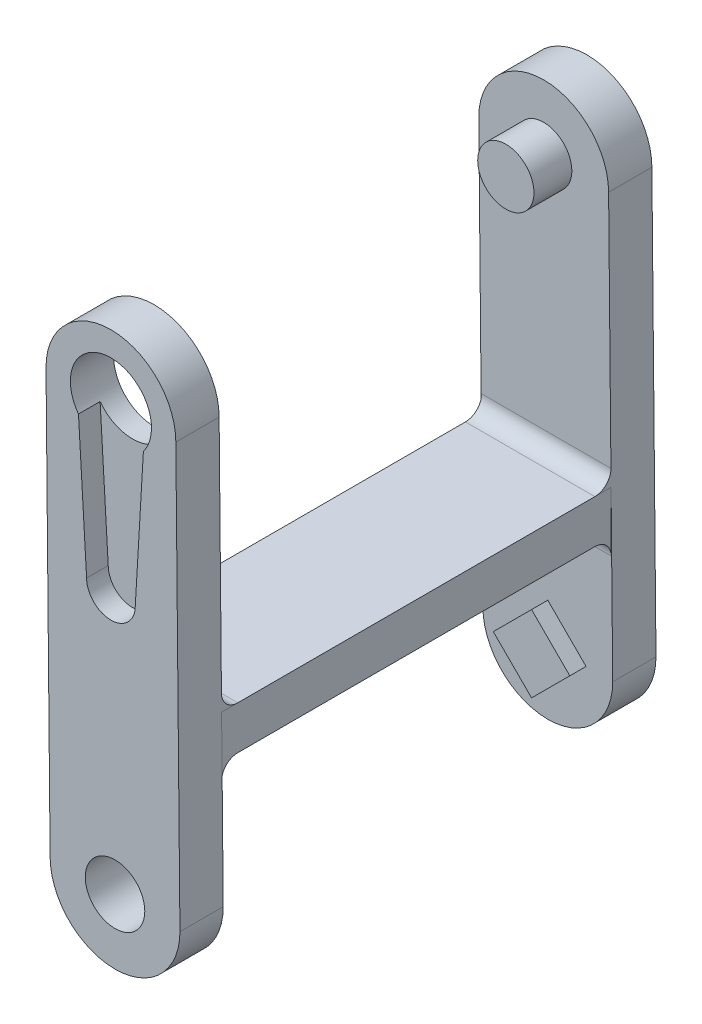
ISO-10303-21;
HEADER;
FILE_DESCRIPTION(('STEP AP214'),'2;1');
FILE_NAME('part.step','',(''),(''),'','','');
FILE_SCHEMA(('AUTOMOTIVE_DESIGN { 1 0 10303 214 1 1 1 1 }'));
ENDSEC;
DATA;
#1=APPLICATION_CONTEXT('core data for automotive mechanical design processes');
#2=APPLICATION_PROTOCOL_DEFINITION('international standard','automotive_design',2000,#1);
#3=PRODUCT_CONTEXT('',#1,'mechanical');
#4=PRODUCT('Part','Part','',(#3));
#5=PRODUCT_RELATED_PRODUCT_CATEGORY('part','',(#4));
#6=PRODUCT_DEFINITION_FORMATION('','',#4);
#7=PRODUCT_DEFINITION_CONTEXT('part definition',#1,'design');
#8=PRODUCT_DEFINITION('design','',#6,#7);
#9=PRODUCT_DEFINITION_SHAPE('','',#8);
#10=(LENGTH_UNIT() NAMED_UNIT(*) SI_UNIT(.MILLI.,.METRE.));
#11=(NAMED_UNIT(*) PLANE_ANGLE_UNIT() SI_UNIT($,.RADIAN.));
#12=(NAMED_UNIT(*) SI_UNIT($,.STERADIAN.) SOLID_ANGLE_UNIT());
#13=UNCERTAINTY_MEASURE_WITH_UNIT(LENGTH_MEASURE(1.E-05),#10,'distance_accuracy_value','');
#14=(GEOMETRIC_REPRESENTATION_CONTEXT(3) GLOBAL_UNCERTAINTY_ASSIGNED_CONTEXT((#13)) GLOBAL_UNIT_ASSIGNED_CONTEXT((#10,
#11,#12)) REPRESENTATION_CONTEXT('',''));
#15=CARTESIAN_POINT('',(0.,0.,0.));
#16=DIRECTION('',(0.,0.,1.));
#17=DIRECTION('',(1.,0.,0.));
#18=AXIS2_PLACEMENT_3D('',#15,#16,#17);
#19=CARTESIAN_POINT('',(0.,0.,0.));
#20=DIRECTION('',(0.,0.,1.));
#21=DIRECTION('',(1.,0.,0.));
#22=AXIS2_PLACEMENT_3D('',#19,#20,#21);
#23=PLANE('',#22);
#24=CARTESIAN_POINT('',(4.90777895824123,0.,0.));
#25=DIRECTION('',(0.,0.,1.));
#26=DIRECTION('',(1.,0.,0.));
#27=AXIS2_PLACEMENT_3D('',#24,#25,#26);
#28=CIRCLE('',#27,3.75);
#29=CARTESIAN_POINT('',(8.65777895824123,0.,0.));
#30=VERTEX_POINT('',#29);
#31=EDGE_CURVE('E229',#30,#30,#28,.T.);
#32=ORIENTED_EDGE('',*,*,#31,.T.);
#33=EDGE_LOOP('',(#32));
#34=FACE_BOUND('',#33,.T.);
#35=DIRECTION('',(0.00972429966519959,-0.999952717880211,0.));
#36=VECTOR('',#35,1.);
#37=CARTESIAN_POINT('',(10.906747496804,0.106065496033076,0.));
#38=LINE('',#37,#36);
#39=CARTESIAN_POINT('',(10.9077789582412,0.,0.));
#40=VERTEX_POINT('',#39);
#41=CARTESIAN_POINT('',(11.121723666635,-22.,0.));
#42=VERTEX_POINT('',#41);
#43=EDGE_CURVE('E265',#40,#42,#38,.T.);
#44=ORIENTED_EDGE('',*,*,#43,.T.);
#45=DIRECTION('',(1.,0.,0.));
#46=VECTOR('',#45,1.);
#47=CARTESIAN_POINT('',(-0.824790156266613,-22.,0.));
#48=LINE('',#47,#46);
#49=CARTESIAN_POINT('',(-0.824790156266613,-22.,0.));
#50=VERTEX_POINT('',#49);
#51=EDGE_CURVE('E174',#42,#50,#48,.F.);
#52=ORIENTED_EDGE('',*,*,#51,.T.);
#53=DIRECTION('',(0.,1.,0.));
#54=VECTOR('',#53,1.);
#55=CARTESIAN_POINT('',(-0.824790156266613,-27.5,0.));
#56=LINE('',#55,#54);
#57=CARTESIAN_POINT('',(-0.824790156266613,-27.5,0.));
#58=VERTEX_POINT('',#57);
#59=EDGE_CURVE('E297',#58,#50,#56,.T.);
#60=ORIENTED_EDGE('',*,*,#59,.F.);
#61=DIRECTION('',(0.00972429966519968,-0.999952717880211,0.));
#62=VECTOR('',#61,1.);
#63=CARTESIAN_POINT('',(-1.09211775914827,-0.0106205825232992,0.));
#64=LINE('',#63,#62);
#65=CARTESIAN_POINT('',(-1.09222104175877,0.,0.));
#66=VERTEX_POINT('',#65);
#67=EDGE_CURVE('E258',#66,#58,#64,.T.);
#68=ORIENTED_EDGE('',*,*,#67,.F.);
#69=CARTESIAN_POINT('',(4.90777895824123,0.,0.));
#70=DIRECTION('',(0.,0.,1.));
#71=DIRECTION('',(1.,0.,0.));
#72=AXIS2_PLACEMENT_3D('',#69,#70,#71);
#73=CIRCLE('',#72,6.);
#74=EDGE_CURVE('E242',#40,#66,#73,.T.);
#75=ORIENTED_EDGE('',*,*,#74,.F.);
#76=EDGE_LOOP('',(#44,#52,#60,#68,#75));
#77=FACE_BOUND('',#76,.T.);
#78=ADVANCED_FACE('F34',(#34,#77),#23,.F.);
#79=CARTESIAN_POINT('',(5.28704457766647,-39.,0.));
#80=DIRECTION('',(0.,0.,1.));
#81=DIRECTION('',(1.,0.,0.));
#82=AXIS2_PLACEMENT_3D('',#79,#80,#81);
#83=CIRCLE('',#82,2.75);
#84=CARTESIAN_POINT('',(8.03704457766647,-39.,0.));
#85=VERTEX_POINT('',#84);
#86=EDGE_CURVE('E339',#85,#85,#83,.F.);
#87=ORIENTED_EDGE('',*,*,#86,.F.);
#88=EDGE_LOOP('',(#87));
#89=FACE_BOUND('',#88,.T.);
#90=CARTESIAN_POINT('',(-0.81020301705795,-29.,0.));
#91=VERTEX_POINT('',#90);
#92=CARTESIAN_POINT('',(-0.71295542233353,-39.,0.));
#93=VERTEX_POINT('',#92);
#94=EDGE_CURVE('E257',#91,#93,#64,.T.);
#95=ORIENTED_EDGE('',*,*,#94,.F.);
#96=DIRECTION('',(-1.,0.,0.));
#97=VECTOR('',#96,1.);
#98=CARTESIAN_POINT('',(11.1363108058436,-29.,0.));
#99=LINE('',#98,#97);
#100=CARTESIAN_POINT('',(11.1363108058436,-29.,0.));
#101=VERTEX_POINT('',#100);
#102=EDGE_CURVE('E162',#91,#101,#99,.F.);
#103=ORIENTED_EDGE('',*,*,#102,.T.);
#104=DIRECTION('',(0.,-1.,0.));
#105=VECTOR('',#104,1.);
#106=CARTESIAN_POINT('',(11.1363108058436,-27.5,0.));
#107=LINE('',#106,#105);
#108=CARTESIAN_POINT('',(11.1363108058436,-23.5,0.));
#109=VERTEX_POINT('',#108);
#110=EDGE_CURVE('E295',#109,#101,#107,.T.);
#111=ORIENTED_EDGE('',*,*,#110,.F.);
#112=CARTESIAN_POINT('',(11.2870445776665,-39.,0.));
#113=VERTEX_POINT('',#112);
#114=EDGE_CURVE('E264',#109,#113,#38,.T.);
#115=ORIENTED_EDGE('',*,*,#114,.T.);
#116=CARTESIAN_POINT('',(5.28704457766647,-39.,0.));
#117=DIRECTION('',(0.,0.,1.));
#118=DIRECTION('',(1.,0.,0.));
#119=AXIS2_PLACEMENT_3D('',#116,#117,#118);
#120=CIRCLE('',#119,6.);
#121=EDGE_CURVE('E261',#93,#113,#120,.T.);
#122=ORIENTED_EDGE('',*,*,#121,.F.);
#123=EDGE_LOOP('',(#95,#103,#111,#115,#122));
#124=FACE_BOUND('',#123,.T.);
#125=ADVANCED_FACE('F489',(#89,#124),#23,.F.);
#126=CARTESIAN_POINT('',(-1.09211775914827,-0.0106205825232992,4.));
#127=DIRECTION('',(0.999952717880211,0.00972429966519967,0.));
#128=DIRECTION('',(-0.00972429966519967,0.999952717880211,0.));
#129=AXIS2_PLACEMENT_3D('',#126,#127,#128);
#130=PLANE('',#129);
#131=ORIENTED_EDGE('',*,*,#67,.T.);
#132=DIRECTION('',(0.,0.,-1.));
#133=VECTOR('',#132,1.);
#134=CARTESIAN_POINT('',(-0.824790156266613,-27.5,4.));
#135=LINE('',#134,#133);
#136=CARTESIAN_POINT('',(-0.824790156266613,-27.5,-1.5));
#137=VERTEX_POINT('',#136);
#138=EDGE_CURVE('E112',#58,#137,#135,.T.);
#139=ORIENTED_EDGE('',*,*,#138,.T.);
#140=CARTESIAN_POINT('',(-0.81020301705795,-29.,-1.5));
#141=DIRECTION('',(0.999952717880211,0.00972429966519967,0.));
#142=DIRECTION('',(0.00972429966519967,-0.999952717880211,0.));
#143=AXIS2_PLACEMENT_3D('',#140,#141,#142);
#144=ELLIPSE('',#143,1.50007092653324,1.5);
#145=EDGE_CURVE('E102',#137,#91,#144,.T.);
#146=ORIENTED_EDGE('',*,*,#145,.T.);
#147=ORIENTED_EDGE('',*,*,#94,.T.);
#148=DIRECTION('',(0.,0.,-1.));
#149=VECTOR('',#148,1.);
#150=CARTESIAN_POINT('',(-0.71295542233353,-39.,4.));
#151=LINE('',#150,#149);
#152=CARTESIAN_POINT('',(-0.71295542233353,-39.,4.));
#153=VERTEX_POINT('',#152);
#154=EDGE_CURVE('E278',#153,#93,#151,.T.);
#155=ORIENTED_EDGE('',*,*,#154,.F.);
#156=DIRECTION('',(0.00972429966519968,-0.999952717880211,0.));
#157=VECTOR('',#156,1.);
#158=CARTESIAN_POINT('',(-1.09211775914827,-0.0106205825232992,4.));
#159=LINE('',#158,#157);
#160=CARTESIAN_POINT('',(-1.09222104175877,0.,4.));
#161=VERTEX_POINT('',#160);
#162=EDGE_CURVE('E241',#161,#153,#159,.T.);
#163=ORIENTED_EDGE('',*,*,#162,.F.);
#164=DIRECTION('',(0.,0.,-1.));
#165=VECTOR('',#164,1.);
#166=CARTESIAN_POINT('',(-1.09222104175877,0.,4.));
#167=LINE('',#166,#165);
#168=EDGE_CURVE('E254',#161,#66,#167,.T.);
#169=ORIENTED_EDGE('',*,*,#168,.T.);
#170=EDGE_LOOP('',(#131,#139,#146,#147,#155,#163,#169));
#171=FACE_BOUND('',#170,.T.);
#172=ADVANCED_FACE('F480',(#171),#130,.F.);
#173=CARTESIAN_POINT('',(5.28704457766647,-39.,4.));
#174=DIRECTION('',(0.,0.,-1.));
#175=DIRECTION('',(-1.,0.,0.));
#176=AXIS2_PLACEMENT_3D('',#173,#174,#175);
#177=CYLINDRICAL_SURFACE('',#176,6.);
#178=ORIENTED_EDGE('',*,*,#121,.T.);
#179=DIRECTION('',(0.,0.,-1.));
#180=VECTOR('',#179,1.);
#181=CARTESIAN_POINT('',(11.2870445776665,-39.,4.));
#182=LINE('',#181,#180);
#183=CARTESIAN_POINT('',(11.2870445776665,-39.,4.));
#184=VERTEX_POINT('',#183);
#185=EDGE_CURVE('E275',#184,#113,#182,.T.);
#186=ORIENTED_EDGE('',*,*,#185,.F.);
#187=CARTESIAN_POINT('',(5.28704457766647,-39.,4.));
#188=DIRECTION('',(0.,0.,1.));
#189=DIRECTION('',(1.,0.,0.));
#190=AXIS2_PLACEMENT_3D('',#187,#188,#189);
#191=CIRCLE('',#190,6.);
#192=EDGE_CURVE('E245',#153,#184,#191,.T.);
#193=ORIENTED_EDGE('',*,*,#192,.F.);
#194=ORIENTED_EDGE('',*,*,#154,.T.);
#195=EDGE_LOOP('',(#178,#186,#193,#194));
#196=FACE_BOUND('',#195,.T.);
#197=ADVANCED_FACE('F506',(#196),#177,.T.);
#198=CARTESIAN_POINT('',(10.906747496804,0.106065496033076,4.));
#199=DIRECTION('',(0.999952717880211,0.00972429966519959,0.));
#200=DIRECTION('',(-0.00972429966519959,0.999952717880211,0.));
#201=AXIS2_PLACEMENT_3D('',#198,#199,#200);
#202=PLANE('',#201);
#203=ORIENTED_EDGE('',*,*,#43,.F.);
#204=DIRECTION('',(0.,0.,-1.));
#205=VECTOR('',#204,1.);
#206=CARTESIAN_POINT('',(10.9077789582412,0.,4.));
#207=LINE('',#206,#205);
#208=CARTESIAN_POINT('',(10.9077789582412,0.,4.));
#209=VERTEX_POINT('',#208);
#210=EDGE_CURVE('E272',#209,#40,#207,.T.);
#211=ORIENTED_EDGE('',*,*,#210,.F.);
#212=DIRECTION('',(0.00972429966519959,-0.999952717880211,0.));
#213=VECTOR('',#212,1.);
#214=CARTESIAN_POINT('',(10.906747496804,0.106065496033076,4.));
#215=LINE('',#214,#213);
#216=EDGE_CURVE('E248',#209,#184,#215,.T.);
#217=ORIENTED_EDGE('',*,*,#216,.T.);
#218=ORIENTED_EDGE('',*,*,#185,.T.);
#219=ORIENTED_EDGE('',*,*,#114,.F.);
#220=DIRECTION('',(0.,0.,-1.));
#221=VECTOR('',#220,1.);
#222=CARTESIAN_POINT('',(11.1363108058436,-23.5,-36.));
#223=LINE('',#222,#221);
#224=CARTESIAN_POINT('',(11.1363108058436,-23.5,-1.5));
#225=VERTEX_POINT('',#224);
#226=EDGE_CURVE('E11',#109,#225,#223,.T.);
#227=ORIENTED_EDGE('',*,*,#226,.T.);
#228=CARTESIAN_POINT('',(11.121723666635,-22.,-1.5));
#229=DIRECTION('',(0.999952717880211,0.00972429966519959,0.));
#230=DIRECTION('',(-0.00972429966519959,0.999952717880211,0.));
#231=AXIS2_PLACEMENT_3D('',#228,#229,#230);
#232=ELLIPSE('',#231,1.50007092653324,1.5);
#233=EDGE_CURVE('E72',#225,#42,#232,.F.);
#234=ORIENTED_EDGE('',*,*,#233,.T.);
#235=EDGE_LOOP('',(#203,#211,#217,#218,#219,#227,#234));
#236=FACE_BOUND('',#235,.T.);
#237=ADVANCED_FACE('F503',(#236),#202,.T.);
#238=CARTESIAN_POINT('',(4.90777895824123,0.,4.));
#239=DIRECTION('',(0.,0.,-1.));
#240=DIRECTION('',(-1.,0.,0.));
#241=AXIS2_PLACEMENT_3D('',#238,#239,#240);
#242=CYLINDRICAL_SURFACE('',#241,3.75);
#243=DIRECTION('',(0.,0.,1.));
#244=VECTOR('',#243,1.);
#245=CARTESIAN_POINT('',(1.90777895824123,-2.25,2.));
#246=LINE('',#245,#244);
#247=CARTESIAN_POINT('',(1.90777895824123,-2.25,2.));
#248=VERTEX_POINT('',#247);
#249=CARTESIAN_POINT('',(1.90777895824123,-2.25,4.));
#250=VERTEX_POINT('',#249);
#251=EDGE_CURVE('E230',#248,#250,#246,.T.);
#252=ORIENTED_EDGE('',*,*,#251,.F.);
#253=CARTESIAN_POINT('',(4.90777895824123,0.,2.));
#254=DIRECTION('',(0.,0.,1.));
#255=DIRECTION('',(1.,0.,0.));
#256=AXIS2_PLACEMENT_3D('',#253,#254,#255);
#257=CIRCLE('',#256,3.75);
#258=CARTESIAN_POINT('',(7.90777895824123,-2.25,2.));
#259=VERTEX_POINT('',#258);
#260=EDGE_CURVE('E281',#248,#259,#257,.T.);
#261=ORIENTED_EDGE('',*,*,#260,.T.);
#262=DIRECTION('',(0.,0.,1.));
#263=VECTOR('',#262,1.);
#264=CARTESIAN_POINT('',(7.90777895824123,-2.25,2.));
#265=LINE('',#264,#263);
#266=CARTESIAN_POINT('',(7.90777895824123,-2.25,4.));
#267=VERTEX_POINT('',#266);
#268=EDGE_CURVE('E233',#259,#267,#265,.T.);
#269=ORIENTED_EDGE('',*,*,#268,.T.);
#270=CARTESIAN_POINT('',(4.90777895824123,0.,4.));
#271=DIRECTION('',(0.,0.,1.));
#272=DIRECTION('',(1.,0.,0.));
#273=AXIS2_PLACEMENT_3D('',#270,#271,#272);
#274=CIRCLE('',#273,3.75);
#275=EDGE_CURVE('E238',#267,#250,#274,.T.);
#276=ORIENTED_EDGE('',*,*,#275,.T.);
#277=EDGE_LOOP('',(#252,#261,#269,#276));
#278=FACE_BOUND('',#277,.T.);
#279=ORIENTED_EDGE('',*,*,#31,.F.);
#280=EDGE_LOOP('',(#279));
#281=FACE_BOUND('',#280,.T.);
#282=ADVANCED_FACE('F502',(#278,#281),#242,.F.);
#283=CARTESIAN_POINT('',(4.90777895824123,0.,4.));
#284=DIRECTION('',(0.,0.,-1.));
#285=DIRECTION('',(-1.,0.,0.));
#286=AXIS2_PLACEMENT_3D('',#283,#284,#285);
#287=CYLINDRICAL_SURFACE('',#286,6.);
#288=ORIENTED_EDGE('',*,*,#74,.T.);
#289=ORIENTED_EDGE('',*,*,#168,.F.);
#290=CARTESIAN_POINT('',(4.90777895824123,0.,4.));
#291=DIRECTION('',(0.,0.,1.));
#292=DIRECTION('',(1.,0.,0.));
#293=AXIS2_PLACEMENT_3D('',#290,#291,#292);
#294=CIRCLE('',#293,6.);
#295=EDGE_CURVE('E251',#209,#161,#294,.T.);
#296=ORIENTED_EDGE('',*,*,#295,.F.);
#297=ORIENTED_EDGE('',*,*,#210,.T.);
#298=EDGE_LOOP('',(#288,#289,#296,#297));
#299=FACE_BOUND('',#298,.T.);
#300=ADVANCED_FACE('F473',(#299),#287,.T.);
#301=CARTESIAN_POINT('',(0.,0.,4.));
#302=DIRECTION('',(0.,0.,1.));
#303=DIRECTION('',(1.,0.,0.));
#304=AXIS2_PLACEMENT_3D('',#301,#302,#303);
#305=PLANE('',#304);
#306=CARTESIAN_POINT('',(5.28704457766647,-39.,4.));
#307=DIRECTION('',(0.,0.,1.));
#308=DIRECTION('',(1.,0.,0.));
#309=AXIS2_PLACEMENT_3D('',#306,#307,#308);
#310=CIRCLE('',#309,2.75);
#311=CARTESIAN_POINT('',(8.03704457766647,-39.,4.));
#312=VERTEX_POINT('',#311);
#313=EDGE_CURVE('E342',#312,#312,#310,.T.);
#314=ORIENTED_EDGE('',*,*,#313,.F.);
#315=EDGE_LOOP('',(#314));
#316=FACE_BOUND('',#315,.T.);
#317=DIRECTION('',(0.0587220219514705,-0.998274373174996,0.));
#318=VECTOR('',#317,1.);
#319=CARTESIAN_POINT('',(2.65777895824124,-15.,4.));
#320=LINE('',#319,#318);
#321=CARTESIAN_POINT('',(2.65777895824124,-15.,4.));
#322=VERTEX_POINT('',#321);
#323=EDGE_CURVE('E215',#250,#322,#320,.T.);
#324=ORIENTED_EDGE('',*,*,#323,.F.);
#325=ORIENTED_EDGE('',*,*,#275,.F.);
#326=DIRECTION('',(0.0587220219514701,0.998274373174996,0.));
#327=VECTOR('',#326,1.);
#328=CARTESIAN_POINT('',(7.15777895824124,-15.,4.));
#329=LINE('',#328,#327);
#330=CARTESIAN_POINT('',(7.15777895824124,-15.,4.));
#331=VERTEX_POINT('',#330);
#332=EDGE_CURVE('E206',#331,#267,#329,.T.);
#333=ORIENTED_EDGE('',*,*,#332,.F.);
#334=CARTESIAN_POINT('',(4.90777895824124,-15.,4.));
#335=DIRECTION('',(0.,0.,1.));
#336=DIRECTION('',(1.,0.,0.));
#337=AXIS2_PLACEMENT_3D('',#334,#335,#336);
#338=CIRCLE('',#337,2.25);
#339=EDGE_CURVE('E204',#322,#331,#338,.T.);
#340=ORIENTED_EDGE('',*,*,#339,.F.);
#341=EDGE_LOOP('',(#324,#325,#333,#340));
#342=FACE_BOUND('',#341,.T.);
#343=ORIENTED_EDGE('',*,*,#162,.T.);
#344=ORIENTED_EDGE('',*,*,#192,.T.);
#345=ORIENTED_EDGE('',*,*,#216,.F.);
#346=ORIENTED_EDGE('',*,*,#295,.T.);
#347=EDGE_LOOP('',(#343,#344,#345,#346));
#348=FACE_BOUND('',#347,.T.);
#349=ADVANCED_FACE('F498',(#316,#342,#348),#305,.T.);
#350=CARTESIAN_POINT('',(4.90777895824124,-15.,2.));
#351=DIRECTION('',(0.,0.,1.));
#352=DIRECTION('',(1.,0.,0.));
#353=AXIS2_PLACEMENT_3D('',#350,#351,#352);
#354=CYLINDRICAL_SURFACE('',#353,2.25);
#355=ORIENTED_EDGE('',*,*,#339,.T.);
#356=DIRECTION('',(0.,0.,1.));
#357=VECTOR('',#356,1.);
#358=CARTESIAN_POINT('',(7.15777895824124,-15.,2.));
#359=LINE('',#358,#357);
#360=CARTESIAN_POINT('',(7.15777895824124,-15.,2.));
#361=VERTEX_POINT('',#360);
#362=EDGE_CURVE('E220',#361,#331,#359,.T.);
#363=ORIENTED_EDGE('',*,*,#362,.F.);
#364=CARTESIAN_POINT('',(4.90777895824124,-15.,2.));
#365=DIRECTION('',(0.,0.,1.));
#366=DIRECTION('',(1.,0.,0.));
#367=AXIS2_PLACEMENT_3D('',#364,#365,#366);
#368=CIRCLE('',#367,2.25);
#369=CARTESIAN_POINT('',(2.65777895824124,-15.,2.));
#370=VERTEX_POINT('',#369);
#371=EDGE_CURVE('E211',#370,#361,#368,.T.);
#372=ORIENTED_EDGE('',*,*,#371,.F.);
#373=DIRECTION('',(0.,0.,1.));
#374=VECTOR('',#373,1.);
#375=CARTESIAN_POINT('',(2.65777895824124,-15.,2.));
#376=LINE('',#375,#374);
#377=EDGE_CURVE('E226',#370,#322,#376,.T.);
#378=ORIENTED_EDGE('',*,*,#377,.T.);
#379=EDGE_LOOP('',(#355,#363,#372,#378));
#380=FACE_BOUND('',#379,.T.);
#381=ADVANCED_FACE('F641',(#380),#354,.F.);
#382=CARTESIAN_POINT('',(2.65777895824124,-15.,2.));
#383=DIRECTION('',(-0.998274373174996,-0.0587220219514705,0.));
#384=DIRECTION('',(0.0587220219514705,-0.998274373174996,0.));
#385=AXIS2_PLACEMENT_3D('',#382,#383,#384);
#386=PLANE('',#385);
#387=ORIENTED_EDGE('',*,*,#323,.T.);
#388=ORIENTED_EDGE('',*,*,#377,.F.);
#389=DIRECTION('',(0.0587220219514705,-0.998274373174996,0.));
#390=VECTOR('',#389,1.);
#391=CARTESIAN_POINT('',(2.65777895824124,-15.,2.));
#392=LINE('',#391,#390);
#393=EDGE_CURVE('E218',#248,#370,#392,.T.);
#394=ORIENTED_EDGE('',*,*,#393,.F.);
#395=ORIENTED_EDGE('',*,*,#251,.T.);
#396=EDGE_LOOP('',(#387,#388,#394,#395));
#397=FACE_BOUND('',#396,.T.);
#398=ADVANCED_FACE('F638',(#397),#386,.F.);
#399=CARTESIAN_POINT('',(7.15777895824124,-15.,2.));
#400=DIRECTION('',(0.998274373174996,-0.0587220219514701,0.));
#401=DIRECTION('',(0.0587220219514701,0.998274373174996,0.));
#402=AXIS2_PLACEMENT_3D('',#399,#400,#401);
#403=PLANE('',#402);
#404=ORIENTED_EDGE('',*,*,#332,.T.);
#405=ORIENTED_EDGE('',*,*,#268,.F.);
#406=DIRECTION('',(0.0587220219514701,0.998274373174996,0.));
#407=VECTOR('',#406,1.);
#408=CARTESIAN_POINT('',(7.15777895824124,-15.,2.));
#409=LINE('',#408,#407);
#410=EDGE_CURVE('E214',#361,#259,#409,.T.);
#411=ORIENTED_EDGE('',*,*,#410,.F.);
#412=ORIENTED_EDGE('',*,*,#362,.T.);
#413=EDGE_LOOP('',(#404,#405,#411,#412));
#414=FACE_BOUND('',#413,.T.);
#415=ADVANCED_FACE('F636',(#414),#403,.F.);
#416=CARTESIAN_POINT('',(4.90777895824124,-15.,2.));
#417=DIRECTION('',(0.,0.,1.));
#418=DIRECTION('',(1.,0.,0.));
#419=AXIS2_PLACEMENT_3D('',#416,#417,#418);
#420=PLANE('',#419);
#421=ORIENTED_EDGE('',*,*,#393,.T.);
#422=ORIENTED_EDGE('',*,*,#371,.T.);
#423=ORIENTED_EDGE('',*,*,#410,.T.);
#424=ORIENTED_EDGE('',*,*,#260,.F.);
#425=EDGE_LOOP('',(#421,#422,#423,#424));
#426=FACE_BOUND('',#425,.T.);
#427=ADVANCED_FACE('F633',(#426),#420,.T.);
#428=CARTESIAN_POINT('',(-0.824790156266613,-27.5,-36.));
#429=DIRECTION('',(1.,0.,0.));
#430=DIRECTION('',(0.,0.,-1.));
#431=AXIS2_PLACEMENT_3D('',#428,#429,#430);
#432=PLANE('',#431);
#433=ORIENTED_EDGE('',*,*,#59,.T.);
#434=CARTESIAN_POINT('',(-0.824790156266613,-22.,-1.5));
#435=DIRECTION('',(1.,0.,0.));
#436=DIRECTION('',(0.,0.,-1.));
#437=AXIS2_PLACEMENT_3D('',#434,#435,#436);
#438=CIRCLE('',#437,1.5);
#439=CARTESIAN_POINT('',(-0.824790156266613,-23.5,-1.5));
#440=VERTEX_POINT('',#439);
#441=EDGE_CURVE('E185',#50,#440,#438,.T.);
#442=ORIENTED_EDGE('',*,*,#441,.T.);
#443=DIRECTION('',(0.,0.,1.));
#444=VECTOR('',#443,1.);
#445=CARTESIAN_POINT('',(-0.824790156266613,-23.5,-36.));
#446=LINE('',#445,#444);
#447=CARTESIAN_POINT('',(-0.824790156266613,-23.5,-34.5));
#448=VERTEX_POINT('',#447);
#449=EDGE_CURVE('E201',#448,#440,#446,.T.);
#450=ORIENTED_EDGE('',*,*,#449,.F.);
#451=CARTESIAN_POINT('',(-0.824790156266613,-22.,-34.5));
#452=DIRECTION('',(1.,0.,0.));
#453=DIRECTION('',(0.,0.,-1.));
#454=AXIS2_PLACEMENT_3D('',#451,#452,#453);
#455=CIRCLE('',#454,1.5);
#456=CARTESIAN_POINT('',(-0.824790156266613,-22.,-36.));
#457=VERTEX_POINT('',#456);
#458=EDGE_CURVE('E182',#448,#457,#455,.T.);
#459=ORIENTED_EDGE('',*,*,#458,.T.);
#460=DIRECTION('',(0.,1.,0.));
#461=VECTOR('',#460,1.);
#462=CARTESIAN_POINT('',(-0.824790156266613,-27.5,-36.));
#463=LINE('',#462,#461);
#464=CARTESIAN_POINT('',(-0.824790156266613,-27.5,-36.));
#465=VERTEX_POINT('',#464);
#466=EDGE_CURVE('E82',#465,#457,#463,.T.);
#467=ORIENTED_EDGE('',*,*,#466,.F.);
#468=DIRECTION('',(0.,0.,1.));
#469=VECTOR('',#468,1.);
#470=CARTESIAN_POINT('',(-0.824790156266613,-27.5,-36.));
#471=LINE('',#470,#469);
#472=CARTESIAN_POINT('',(-0.824790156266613,-27.5,-34.5));
#473=VERTEX_POINT('',#472);
#474=EDGE_CURVE('E188',#465,#473,#471,.T.);
#475=ORIENTED_EDGE('',*,*,#474,.T.);
#476=DIRECTION('',(0.,0.,1.));
#477=VECTOR('',#476,1.);
#478=CARTESIAN_POINT('',(-0.824790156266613,-27.5,-36.));
#479=LINE('',#478,#477);
#480=EDGE_CURVE('E146',#473,#137,#479,.T.);
#481=ORIENTED_EDGE('',*,*,#480,.T.);
#482=ORIENTED_EDGE('',*,*,#138,.F.);
#483=EDGE_LOOP('',(#433,#442,#450,#459,#467,#475,#481,#482));
#484=FACE_BOUND('',#483,.T.);
#485=ADVANCED_FACE('F202',(#484),#432,.F.);
#486=CARTESIAN_POINT('',(-0.824790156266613,-23.5,-36.));
#487=DIRECTION('',(0.,-1.,0.));
#488=DIRECTION('',(0.,0.,-1.));
#489=AXIS2_PLACEMENT_3D('',#486,#487,#488);
#490=PLANE('',#489);
#491=DIRECTION('',(0.,0.,1.));
#492=VECTOR('',#491,1.);
#493=CARTESIAN_POINT('',(11.1363108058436,-23.5,-36.));
#494=LINE('',#493,#492);
#495=CARTESIAN_POINT('',(11.1363108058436,-23.5,-34.5));
#496=VERTEX_POINT('',#495);
#497=EDGE_CURVE('E58',#496,#225,#494,.T.);
#498=ORIENTED_EDGE('',*,*,#497,.F.);
#499=DIRECTION('',(1.,0.,0.));
#500=VECTOR('',#499,1.);
#501=CARTESIAN_POINT('',(-0.824790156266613,-23.5,-34.5));
#502=LINE('',#501,#500);
#503=EDGE_CURVE('E172',#496,#448,#502,.F.);
#504=ORIENTED_EDGE('',*,*,#503,.T.);
#505=ORIENTED_EDGE('',*,*,#449,.T.);
#506=DIRECTION('',(1.,0.,0.));
#507=VECTOR('',#506,1.);
#508=CARTESIAN_POINT('',(11.1363108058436,-23.5,-1.5));
#509=LINE('',#508,#507);
#510=EDGE_CURVE('E164',#440,#225,#509,.T.);
#511=ORIENTED_EDGE('',*,*,#510,.T.);
#512=EDGE_LOOP('',(#498,#504,#505,#511));
#513=FACE_BOUND('',#512,.T.);
#514=ADVANCED_FACE('F200',(#513),#490,.F.);
#515=CARTESIAN_POINT('',(11.1363108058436,-27.5,-36.));
#516=DIRECTION('',(-1.,0.,0.));
#517=DIRECTION('',(0.,0.,1.));
#518=AXIS2_PLACEMENT_3D('',#515,#516,#517);
#519=PLANE('',#518);
#520=ORIENTED_EDGE('',*,*,#110,.T.);
#521=CARTESIAN_POINT('',(11.1363108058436,-29.,-1.5));
#522=DIRECTION('',(-1.,0.,0.));
#523=DIRECTION('',(0.,0.,1.));
#524=AXIS2_PLACEMENT_3D('',#521,#522,#523);
#525=CIRCLE('',#524,1.5);
#526=CARTESIAN_POINT('',(11.1363108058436,-27.5,-1.5));
#527=VERTEX_POINT('',#526);
#528=EDGE_CURVE('E178',#101,#527,#525,.T.);
#529=ORIENTED_EDGE('',*,*,#528,.T.);
#530=DIRECTION('',(0.,0.,1.));
#531=VECTOR('',#530,1.);
#532=CARTESIAN_POINT('',(11.1363108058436,-27.5,-36.));
#533=LINE('',#532,#531);
#534=CARTESIAN_POINT('',(11.1363108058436,-27.5,-34.5));
#535=VERTEX_POINT('',#534);
#536=EDGE_CURVE('E153',#535,#527,#533,.T.);
#537=ORIENTED_EDGE('',*,*,#536,.F.);
#538=CARTESIAN_POINT('',(11.1363108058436,-29.,-34.5));
#539=DIRECTION('',(-1.,0.,0.));
#540=DIRECTION('',(0.,0.,1.));
#541=AXIS2_PLACEMENT_3D('',#538,#539,#540);
#542=CIRCLE('',#541,1.5);
#543=CARTESIAN_POINT('',(11.1363108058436,-29.,-36.));
#544=VERTEX_POINT('',#543);
#545=EDGE_CURVE('E150',#535,#544,#542,.T.);
#546=ORIENTED_EDGE('',*,*,#545,.T.);
#547=DIRECTION('',(0.,-1.,0.));
#548=VECTOR('',#547,1.);
#549=CARTESIAN_POINT('',(11.1363108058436,-27.5,-36.));
#550=LINE('',#549,#548);
#551=CARTESIAN_POINT('',(11.1363108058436,-23.5,-36.));
#552=VERTEX_POINT('',#551);
#553=EDGE_CURVE('E133',#552,#544,#550,.T.);
#554=ORIENTED_EDGE('',*,*,#553,.F.);
#555=DIRECTION('',(0.,0.,1.));
#556=VECTOR('',#555,1.);
#557=CARTESIAN_POINT('',(11.1363108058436,-23.5,-36.));
#558=LINE('',#557,#556);
#559=EDGE_CURVE('E42',#552,#496,#558,.T.);
#560=ORIENTED_EDGE('',*,*,#559,.T.);
#561=ORIENTED_EDGE('',*,*,#497,.T.);
#562=ORIENTED_EDGE('',*,*,#226,.F.);
#563=EDGE_LOOP('',(#520,#529,#537,#546,#554,#560,#561,#562));
#564=FACE_BOUND('',#563,.T.);
#565=ADVANCED_FACE('F151',(#564),#519,.F.);
#566=CARTESIAN_POINT('',(-0.824790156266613,-27.5,-36.));
#567=DIRECTION('',(0.,1.,0.));
#568=DIRECTION('',(0.,0.,1.));
#569=AXIS2_PLACEMENT_3D('',#566,#567,#568);
#570=PLANE('',#569);
#571=ORIENTED_EDGE('',*,*,#536,.T.);
#572=DIRECTION('',(-1.,0.,0.));
#573=VECTOR('',#572,1.);
#574=CARTESIAN_POINT('',(-0.824790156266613,-27.5,-1.5));
#575=LINE('',#574,#573);
#576=EDGE_CURVE('E167',#527,#137,#575,.T.);
#577=ORIENTED_EDGE('',*,*,#576,.T.);
#578=ORIENTED_EDGE('',*,*,#480,.F.);
#579=DIRECTION('',(-1.,0.,0.));
#580=VECTOR('',#579,1.);
#581=CARTESIAN_POINT('',(11.1363108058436,-27.5,-34.5));
#582=LINE('',#581,#580);
#583=EDGE_CURVE('E287',#473,#535,#582,.F.);
#584=ORIENTED_EDGE('',*,*,#583,.T.);
#585=EDGE_LOOP('',(#571,#577,#578,#584));
#586=FACE_BOUND('',#585,.T.);
#587=ADVANCED_FACE('F290',(#586),#570,.F.);
#588=CARTESIAN_POINT('',(4.90777895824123,0.,-36.));
#589=DIRECTION('',(0.,0.,-1.));
#590=DIRECTION('',(-1.,0.,0.));
#591=AXIS2_PLACEMENT_3D('',#588,#589,#590);
#592=PLANE('',#591);
#593=CARTESIAN_POINT('',(4.90777895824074,-6.15853939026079E-13,-36.));
#594=DIRECTION('',(0.,0.,-1.));
#595=DIRECTION('',(-1.,0.,0.));
#596=AXIS2_PLACEMENT_3D('',#593,#594,#595);
#597=CIRCLE('',#596,2.60000000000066);
#598=CARTESIAN_POINT('',(2.30777895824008,-6.15853939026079E-13,-36.));
#599=VERTEX_POINT('',#598);
#600=EDGE_CURVE('E284',#599,#599,#597,.F.);
#601=ORIENTED_EDGE('',*,*,#600,.F.);
#602=EDGE_LOOP('',(#601));
#603=FACE_BOUND('',#602,.T.);
#604=ORIENTED_EDGE('',*,*,#466,.T.);
#605=DIRECTION('',(1.,0.,0.));
#606=VECTOR('',#605,1.);
#607=CARTESIAN_POINT('',(11.1363108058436,-22.,-36.));
#608=LINE('',#607,#606);
#609=CARTESIAN_POINT('',(11.121723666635,-22.,-36.));
#610=VERTEX_POINT('',#609);
#611=EDGE_CURVE('E161',#457,#610,#608,.T.);
#612=ORIENTED_EDGE('',*,*,#611,.T.);
#613=DIRECTION('',(0.00972429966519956,-0.999952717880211,0.));
#614=VECTOR('',#613,1.);
#615=CARTESIAN_POINT('',(11.1363108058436,-23.5,-36.));
#616=LINE('',#615,#614);
#617=CARTESIAN_POINT('',(10.9077789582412,0.,-36.));
#618=VERTEX_POINT('',#617);
#619=EDGE_CURVE('E320',#618,#610,#616,.T.);
#620=ORIENTED_EDGE('',*,*,#619,.F.);
#621=CARTESIAN_POINT('',(4.90777895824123,0.,-36.));
#622=DIRECTION('',(0.,0.,-1.));
#623=DIRECTION('',(-1.,0.,0.));
#624=AXIS2_PLACEMENT_3D('',#621,#622,#623);
#625=CIRCLE('',#624,6.);
#626=CARTESIAN_POINT('',(-1.09222104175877,0.,-36.));
#627=VERTEX_POINT('',#626);
#628=EDGE_CURVE('E323',#627,#618,#625,.T.);
#629=ORIENTED_EDGE('',*,*,#628,.F.);
#630=DIRECTION('',(-0.00972429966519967,0.999952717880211,0.));
#631=VECTOR('',#630,1.);
#632=CARTESIAN_POINT('',(-1.09222104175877,0.,-36.));
#633=LINE('',#632,#631);
#634=EDGE_CURVE('E316',#465,#627,#633,.T.);
#635=ORIENTED_EDGE('',*,*,#634,.F.);
#636=EDGE_LOOP('',(#604,#612,#620,#629,#635));
#637=FACE_BOUND('',#636,.T.);
#638=ADVANCED_FACE('F545',(#603,#637),#592,.F.);
#639=DIRECTION('',(0.707106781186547,0.707106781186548,0.));
#640=VECTOR('',#639,1.);
#641=CARTESIAN_POINT('',(22.8296448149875,-17.9218658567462,-36.));
#642=LINE('',#641,#640);
#643=CARTESIAN_POINT('',(1.75151067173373,-39.,-36.));
#644=VERTEX_POINT('',#643);
#645=CARTESIAN_POINT('',(5.28704457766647,-35.4644660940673,-36.));
#646=VERTEX_POINT('',#645);
#647=EDGE_CURVE('E348',#644,#646,#642,.T.);
#648=ORIENTED_EDGE('',*,*,#647,.T.);
#649=DIRECTION('',(0.707106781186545,-0.70710678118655,0.));
#650=VECTOR('',#649,1.);
#651=CARTESIAN_POINT('',(-12.6348212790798,-17.5426002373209,-36.));
#652=LINE('',#651,#650);
#653=CARTESIAN_POINT('',(8.8225784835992,-39.,-36.));
#654=VERTEX_POINT('',#653);
#655=EDGE_CURVE('E345',#646,#654,#652,.T.);
#656=ORIENTED_EDGE('',*,*,#655,.T.);
#657=DIRECTION('',(-0.707106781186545,-0.70710678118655,0.));
#658=VECTOR('',#657,1.);
#659=CARTESIAN_POINT('',(26.3651787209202,-21.4573997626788,-36.));
#660=LINE('',#659,#658);
#661=CARTESIAN_POINT('',(5.28704457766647,-42.5355339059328,-36.));
#662=VERTEX_POINT('',#661);
#663=EDGE_CURVE('E354',#654,#662,#660,.T.);
#664=ORIENTED_EDGE('',*,*,#663,.T.);
#665=DIRECTION('',(-0.707106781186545,0.70710678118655,0.));
#666=VECTOR('',#665,1.);
#667=CARTESIAN_POINT('',(-16.1703551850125,-21.0781341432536,-36.));
#668=LINE('',#667,#666);
#669=EDGE_CURVE('E351',#662,#644,#668,.T.);
#670=ORIENTED_EDGE('',*,*,#669,.T.);
#671=EDGE_LOOP('',(#648,#656,#664,#670));
#672=FACE_BOUND('',#671,.T.);
#673=ORIENTED_EDGE('',*,*,#553,.T.);
#674=DIRECTION('',(-1.,0.,0.));
#675=VECTOR('',#674,1.);
#676=CARTESIAN_POINT('',(-0.824790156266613,-29.,-36.));
#677=LINE('',#676,#675);
#678=CARTESIAN_POINT('',(-0.81020301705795,-29.,-36.));
#679=VERTEX_POINT('',#678);
#680=EDGE_CURVE('E138',#544,#679,#677,.T.);
#681=ORIENTED_EDGE('',*,*,#680,.T.);
#682=CARTESIAN_POINT('',(-0.71295542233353,-39.,-36.));
#683=VERTEX_POINT('',#682);
#684=EDGE_CURVE('E313',#683,#679,#633,.T.);
#685=ORIENTED_EDGE('',*,*,#684,.F.);
#686=CARTESIAN_POINT('',(5.28704457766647,-39.,-36.));
#687=DIRECTION('',(0.,0.,-1.));
#688=DIRECTION('',(-1.,0.,0.));
#689=AXIS2_PLACEMENT_3D('',#686,#687,#688);
#690=CIRCLE('',#689,6.);
#691=CARTESIAN_POINT('',(11.2870445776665,-39.,-36.));
#692=VERTEX_POINT('',#691);
#693=EDGE_CURVE('E317',#692,#683,#690,.T.);
#694=ORIENTED_EDGE('',*,*,#693,.F.);
#695=EDGE_CURVE('E143',#552,#692,#616,.T.);
#696=ORIENTED_EDGE('',*,*,#695,.F.);
#697=EDGE_LOOP('',(#673,#681,#685,#694,#696));
#698=FACE_BOUND('',#697,.T.);
#699=ADVANCED_FACE('F135',(#672,#698),#592,.F.);
#700=CARTESIAN_POINT('',(4.90777895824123,0.,-40.));
#701=DIRECTION('',(0.,0.,-1.));
#702=DIRECTION('',(-1.,0.,0.));
#703=AXIS2_PLACEMENT_3D('',#700,#701,#702);
#704=PLANE('',#703);
#705=CARTESIAN_POINT('',(4.90777895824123,0.,-40.));
#706=DIRECTION('',(0.,0.,-1.));
#707=DIRECTION('',(-1.,0.,0.));
#708=AXIS2_PLACEMENT_3D('',#705,#706,#707);
#709=CIRCLE('',#708,6.);
#710=CARTESIAN_POINT('',(-1.09222104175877,0.,-40.));
#711=VERTEX_POINT('',#710);
#712=CARTESIAN_POINT('',(10.9077789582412,0.,-40.));
#713=VERTEX_POINT('',#712);
#714=EDGE_CURVE('E315',#711,#713,#709,.T.);
#715=ORIENTED_EDGE('',*,*,#714,.T.);
#716=DIRECTION('',(0.00972429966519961,-0.999952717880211,0.));
#717=VECTOR('',#716,1.);
#718=CARTESIAN_POINT('',(10.9077789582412,0.,-40.));
#719=LINE('',#718,#717);
#720=CARTESIAN_POINT('',(11.2870445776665,-39.,-40.));
#721=VERTEX_POINT('',#720);
#722=EDGE_CURVE('E332',#713,#721,#719,.T.);
#723=ORIENTED_EDGE('',*,*,#722,.T.);
#724=CARTESIAN_POINT('',(5.28704457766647,-39.,-40.));
#725=DIRECTION('',(0.,0.,-1.));
#726=DIRECTION('',(-1.,0.,0.));
#727=AXIS2_PLACEMENT_3D('',#724,#725,#726);
#728=CIRCLE('',#727,6.);
#729=CARTESIAN_POINT('',(-0.71295542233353,-39.,-40.));
#730=VERTEX_POINT('',#729);
#731=EDGE_CURVE('E329',#721,#730,#728,.T.);
#732=ORIENTED_EDGE('',*,*,#731,.T.);
#733=DIRECTION('',(-0.00972429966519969,0.999952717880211,0.));
#734=VECTOR('',#733,1.);
#735=CARTESIAN_POINT('',(-0.824790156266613,-27.5,-40.));
#736=LINE('',#735,#734);
#737=EDGE_CURVE('E312',#730,#711,#736,.T.);
#738=ORIENTED_EDGE('',*,*,#737,.T.);
#739=EDGE_LOOP('',(#715,#723,#732,#738));
#740=FACE_BOUND('',#739,.T.);
#741=ADVANCED_FACE('F544',(#740),#704,.T.);
#742=CARTESIAN_POINT('',(4.90777895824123,0.,-40.));
#743=DIRECTION('',(0.,0.,1.));
#744=DIRECTION('',(1.,0.,0.));
#745=AXIS2_PLACEMENT_3D('',#742,#743,#744);
#746=CYLINDRICAL_SURFACE('',#745,6.);
#747=ORIENTED_EDGE('',*,*,#628,.T.);
#748=DIRECTION('',(0.,0.,1.));
#749=VECTOR('',#748,1.);
#750=CARTESIAN_POINT('',(10.9077789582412,0.,-40.));
#751=LINE('',#750,#749);
#752=EDGE_CURVE('E298',#713,#618,#751,.T.);
#753=ORIENTED_EDGE('',*,*,#752,.F.);
#754=ORIENTED_EDGE('',*,*,#714,.F.);
#755=DIRECTION('',(0.,0.,1.));
#756=VECTOR('',#755,1.);
#757=CARTESIAN_POINT('',(-1.09222104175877,0.,-40.));
#758=LINE('',#757,#756);
#759=EDGE_CURVE('E309',#711,#627,#758,.T.);
#760=ORIENTED_EDGE('',*,*,#759,.T.);
#761=EDGE_LOOP('',(#747,#753,#754,#760));
#762=FACE_BOUND('',#761,.T.);
#763=ADVANCED_FACE('F556',(#762),#746,.T.);
#764=CARTESIAN_POINT('',(11.1363108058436,-23.5,-40.));
#765=DIRECTION('',(-0.999952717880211,-0.00972429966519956,0.));
#766=DIRECTION('',(0.00972429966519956,-0.999952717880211,0.));
#767=AXIS2_PLACEMENT_3D('',#764,#765,#766);
#768=PLANE('',#767);
#769=ORIENTED_EDGE('',*,*,#619,.T.);
#770=CARTESIAN_POINT('',(11.121723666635,-22.,-34.5));
#771=DIRECTION('',(-0.999952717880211,-0.00972429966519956,0.));
#772=DIRECTION('',(-0.00972429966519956,0.999952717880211,0.));
#773=AXIS2_PLACEMENT_3D('',#770,#771,#772);
#774=ELLIPSE('',#773,1.50007092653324,1.5);
#775=EDGE_CURVE('E156',#610,#496,#774,.T.);
#776=ORIENTED_EDGE('',*,*,#775,.T.);
#777=ORIENTED_EDGE('',*,*,#559,.F.);
#778=ORIENTED_EDGE('',*,*,#695,.T.);
#779=DIRECTION('',(0.,0.,1.));
#780=VECTOR('',#779,1.);
#781=CARTESIAN_POINT('',(11.2870445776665,-39.,-40.));
#782=LINE('',#781,#780);
#783=EDGE_CURVE('E303',#721,#692,#782,.T.);
#784=ORIENTED_EDGE('',*,*,#783,.F.);
#785=ORIENTED_EDGE('',*,*,#722,.F.);
#786=ORIENTED_EDGE('',*,*,#752,.T.);
#787=EDGE_LOOP('',(#769,#776,#777,#778,#784,#785,#786));
#788=FACE_BOUND('',#787,.T.);
#789=ADVANCED_FACE('F619',(#788),#768,.F.);
#790=CARTESIAN_POINT('',(5.28704457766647,-39.,-40.));
#791=DIRECTION('',(0.,0.,1.));
#792=DIRECTION('',(1.,0.,0.));
#793=AXIS2_PLACEMENT_3D('',#790,#791,#792);
#794=CYLINDRICAL_SURFACE('',#793,6.);
#795=ORIENTED_EDGE('',*,*,#693,.T.);
#796=DIRECTION('',(0.,0.,1.));
#797=VECTOR('',#796,1.);
#798=CARTESIAN_POINT('',(-0.71295542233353,-39.,-40.));
#799=LINE('',#798,#797);
#800=EDGE_CURVE('E306',#730,#683,#799,.T.);
#801=ORIENTED_EDGE('',*,*,#800,.F.);
#802=ORIENTED_EDGE('',*,*,#731,.F.);
#803=ORIENTED_EDGE('',*,*,#783,.T.);
#804=EDGE_LOOP('',(#795,#801,#802,#803));
#805=FACE_BOUND('',#804,.T.);
#806=ADVANCED_FACE('F615',(#805),#794,.T.);
#807=CARTESIAN_POINT('',(-1.09222104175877,0.,-40.));
#808=DIRECTION('',(0.999952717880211,0.00972429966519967,0.));
#809=DIRECTION('',(-0.00972429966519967,0.999952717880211,0.));
#810=AXIS2_PLACEMENT_3D('',#807,#808,#809);
#811=PLANE('',#810);
#812=ORIENTED_EDGE('',*,*,#684,.T.);
#813=CARTESIAN_POINT('',(-0.81020301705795,-29.,-34.5));
#814=DIRECTION('',(0.999952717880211,0.00972429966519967,0.));
#815=DIRECTION('',(0.00972429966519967,-0.999952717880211,0.));
#816=AXIS2_PLACEMENT_3D('',#813,#814,#815);
#817=ELLIPSE('',#816,1.50007092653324,1.5);
#818=EDGE_CURVE('E157',#679,#473,#817,.T.);
#819=ORIENTED_EDGE('',*,*,#818,.T.);
#820=ORIENTED_EDGE('',*,*,#474,.F.);
#821=ORIENTED_EDGE('',*,*,#634,.T.);
#822=ORIENTED_EDGE('',*,*,#759,.F.);
#823=ORIENTED_EDGE('',*,*,#737,.F.);
#824=ORIENTED_EDGE('',*,*,#800,.T.);
#825=EDGE_LOOP('',(#812,#819,#820,#821,#822,#823,#824));
#826=FACE_BOUND('',#825,.T.);
#827=ADVANCED_FACE('F609',(#826),#811,.F.);
#828=CARTESIAN_POINT('',(4.90777895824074,-6.15853939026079E-13,-32.5));
#829=DIRECTION('',(0.,0.,-1.));
#830=DIRECTION('',(-1.,0.,0.));
#831=AXIS2_PLACEMENT_3D('',#828,#829,#830);
#832=CYLINDRICAL_SURFACE('',#831,2.60000000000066);
#833=CARTESIAN_POINT('',(4.90777895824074,-6.15853939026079E-13,-32.5));
#834=DIRECTION('',(0.,0.,1.));
#835=DIRECTION('',(1.,0.,0.));
#836=AXIS2_PLACEMENT_3D('',#833,#834,#835);
#837=CIRCLE('',#836,2.60000000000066);
#838=CARTESIAN_POINT('',(7.5077789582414,-6.15853939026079E-13,-32.5));
#839=VERTEX_POINT('',#838);
#840=EDGE_CURVE('E326',#839,#839,#837,.T.);
#841=ORIENTED_EDGE('',*,*,#840,.F.);
#842=EDGE_LOOP('',(#841));
#843=FACE_BOUND('',#842,.T.);
#844=ORIENTED_EDGE('',*,*,#600,.T.);
#845=EDGE_LOOP('',(#844));
#846=FACE_BOUND('',#845,.T.);
#847=ADVANCED_FACE('F606',(#843,#846),#832,.T.);
#848=CARTESIAN_POINT('',(4.90777895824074,-6.15853939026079E-13,-32.5));
#849=DIRECTION('',(0.,0.,1.));
#850=DIRECTION('',(1.,0.,0.));
#851=AXIS2_PLACEMENT_3D('',#848,#849,#850);
#852=PLANE('',#851);
#853=ORIENTED_EDGE('',*,*,#840,.T.);
#854=EDGE_LOOP('',(#853));
#855=FACE_BOUND('',#854,.T.);
#856=ADVANCED_FACE('F602',(#855),#852,.T.);
#857=CARTESIAN_POINT('',(5.28704457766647,-39.,-7.77817459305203));
#858=DIRECTION('',(0.,0.,1.));
#859=DIRECTION('',(1.,0.,0.));
#860=AXIS2_PLACEMENT_3D('',#857,#858,#859);
#861=CYLINDRICAL_SURFACE('',#860,2.75);
#862=ORIENTED_EDGE('',*,*,#86,.T.);
#863=EDGE_LOOP('',(#862));
#864=FACE_BOUND('',#863,.T.);
#865=ORIENTED_EDGE('',*,*,#313,.T.);
#866=EDGE_LOOP('',(#865));
#867=FACE_BOUND('',#866,.T.);
#868=ADVANCED_FACE('F519',(#864,#867),#861,.F.);
#869=CARTESIAN_POINT('',(-0.824790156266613,-29.,-1.5));
#870=DIRECTION('',(1.,0.,0.));
#871=DIRECTION('',(0.,0.,-1.));
#872=AXIS2_PLACEMENT_3D('',#869,#870,#871);
#873=CYLINDRICAL_SURFACE('',#872,1.5);
#874=ORIENTED_EDGE('',*,*,#528,.F.);
#875=ORIENTED_EDGE('',*,*,#102,.F.);
#876=ORIENTED_EDGE('',*,*,#145,.F.);
#877=ORIENTED_EDGE('',*,*,#576,.F.);
#878=EDGE_LOOP('',(#874,#875,#876,#877));
#879=FACE_BOUND('',#878,.T.);
#880=ADVANCED_FACE('F516',(#879),#873,.F.);
#881=CARTESIAN_POINT('',(4.90777895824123,-29.,-34.5));
#882=DIRECTION('',(1.,0.,0.));
#883=DIRECTION('',(0.,0.,-1.));
#884=AXIS2_PLACEMENT_3D('',#881,#882,#883);
#885=CYLINDRICAL_SURFACE('',#884,1.5);
#886=ORIENTED_EDGE('',*,*,#545,.F.);
#887=ORIENTED_EDGE('',*,*,#583,.F.);
#888=ORIENTED_EDGE('',*,*,#818,.F.);
#889=ORIENTED_EDGE('',*,*,#680,.F.);
#890=EDGE_LOOP('',(#886,#887,#888,#889));
#891=FACE_BOUND('',#890,.T.);
#892=ADVANCED_FACE('F159',(#891),#885,.F.);
#893=CARTESIAN_POINT('',(4.90777895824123,-22.,-34.5));
#894=DIRECTION('',(-1.,0.,0.));
#895=DIRECTION('',(0.,0.,1.));
#896=AXIS2_PLACEMENT_3D('',#893,#894,#895);
#897=CYLINDRICAL_SURFACE('',#896,1.5);
#898=ORIENTED_EDGE('',*,*,#458,.F.);
#899=ORIENTED_EDGE('',*,*,#503,.F.);
#900=ORIENTED_EDGE('',*,*,#775,.F.);
#901=ORIENTED_EDGE('',*,*,#611,.F.);
#902=EDGE_LOOP('',(#898,#899,#900,#901));
#903=FACE_BOUND('',#902,.T.);
#904=ADVANCED_FACE('F196',(#903),#897,.F.);
#905=CARTESIAN_POINT('',(-0.824790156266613,-22.,-1.5));
#906=DIRECTION('',(-1.,0.,0.));
#907=DIRECTION('',(0.,0.,1.));
#908=AXIS2_PLACEMENT_3D('',#905,#906,#907);
#909=CYLINDRICAL_SURFACE('',#908,1.5);
#910=ORIENTED_EDGE('',*,*,#441,.F.);
#911=ORIENTED_EDGE('',*,*,#51,.F.);
#912=ORIENTED_EDGE('',*,*,#233,.F.);
#913=ORIENTED_EDGE('',*,*,#510,.F.);
#914=EDGE_LOOP('',(#910,#911,#912,#913));
#915=FACE_BOUND('',#914,.T.);
#916=ADVANCED_FACE('F36',(#915),#909,.F.);
#917=CARTESIAN_POINT('',(8.8225784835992,-39.,-34.5));
#918=DIRECTION('',(0.70710678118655,0.707106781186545,0.));
#919=DIRECTION('',(-0.707106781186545,0.70710678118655,0.));
#920=AXIS2_PLACEMENT_3D('',#917,#918,#919);
#921=PLANE('',#920);
#922=ORIENTED_EDGE('',*,*,#655,.F.);
#923=DIRECTION('',(0.,0.,-1.));
#924=VECTOR('',#923,1.);
#925=CARTESIAN_POINT('',(5.28704457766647,-35.4644660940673,-34.5));
#926=LINE('',#925,#924);
#927=CARTESIAN_POINT('',(5.28704457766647,-35.4644660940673,-34.5));
#928=VERTEX_POINT('',#927);
#929=EDGE_CURVE('E357',#928,#646,#926,.T.);
#930=ORIENTED_EDGE('',*,*,#929,.F.);
#931=DIRECTION('',(0.707106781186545,-0.70710678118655,0.));
#932=VECTOR('',#931,1.);
#933=CARTESIAN_POINT('',(8.8225784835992,-39.,-34.5));
#934=LINE('',#933,#932);
#935=CARTESIAN_POINT('',(8.8225784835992,-39.,-34.5));
#936=VERTEX_POINT('',#935);
#937=EDGE_CURVE('E375',#928,#936,#934,.T.);
#938=ORIENTED_EDGE('',*,*,#937,.T.);
#939=DIRECTION('',(0.,0.,-1.));
#940=VECTOR('',#939,1.);
#941=CARTESIAN_POINT('',(8.8225784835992,-39.,-34.5));
#942=LINE('',#941,#940);
#943=EDGE_CURVE('E358',#936,#654,#942,.T.);
#944=ORIENTED_EDGE('',*,*,#943,.T.);
#945=EDGE_LOOP('',(#922,#930,#938,#944));
#946=FACE_BOUND('',#945,.T.);
#947=ADVANCED_FACE('F382',(#946),#921,.T.);
#948=CARTESIAN_POINT('',(1.75151067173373,-39.,-34.5));
#949=DIRECTION('',(-0.707106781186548,0.707106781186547,0.));
#950=DIRECTION('',(-0.707106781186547,-0.707106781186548,0.));
#951=AXIS2_PLACEMENT_3D('',#948,#949,#950);
#952=PLANE('',#951);
#953=ORIENTED_EDGE('',*,*,#647,.F.);
#954=DIRECTION('',(0.,0.,-1.));
#955=VECTOR('',#954,1.);
#956=CARTESIAN_POINT('',(1.75151067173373,-39.,-34.5));
#957=LINE('',#956,#955);
#958=CARTESIAN_POINT('',(1.75151067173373,-39.,-34.5));
#959=VERTEX_POINT('',#958);
#960=EDGE_CURVE('E363',#959,#644,#957,.T.);
#961=ORIENTED_EDGE('',*,*,#960,.F.);
#962=DIRECTION('',(0.707106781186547,0.707106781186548,0.));
#963=VECTOR('',#962,1.);
#964=CARTESIAN_POINT('',(1.75151067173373,-39.,-34.5));
#965=LINE('',#964,#963);
#966=EDGE_CURVE('E361',#959,#928,#965,.T.);
#967=ORIENTED_EDGE('',*,*,#966,.T.);
#968=ORIENTED_EDGE('',*,*,#929,.T.);
#969=EDGE_LOOP('',(#953,#961,#967,#968));
#970=FACE_BOUND('',#969,.T.);
#971=ADVANCED_FACE('F398',(#970),#952,.T.);
#972=CARTESIAN_POINT('',(1.75151067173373,-39.,-34.5));
#973=DIRECTION('',(-0.70710678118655,-0.707106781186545,0.));
#974=DIRECTION('',(0.707106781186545,-0.70710678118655,0.));
#975=AXIS2_PLACEMENT_3D('',#972,#973,#974);
#976=PLANE('',#975);
#977=ORIENTED_EDGE('',*,*,#669,.F.);
#978=DIRECTION('',(0.,0.,-1.));
#979=VECTOR('',#978,1.);
#980=CARTESIAN_POINT('',(5.28704457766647,-42.5355339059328,-34.5));
#981=LINE('',#980,#979);
#982=CARTESIAN_POINT('',(5.28704457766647,-42.5355339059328,-34.5));
#983=VERTEX_POINT('',#982);
#984=EDGE_CURVE('E49',#983,#662,#981,.T.);
#985=ORIENTED_EDGE('',*,*,#984,.F.);
#986=DIRECTION('',(-0.707106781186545,0.70710678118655,0.));
#987=VECTOR('',#986,1.);
#988=CARTESIAN_POINT('',(1.75151067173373,-39.,-34.5));
#989=LINE('',#988,#987);
#990=EDGE_CURVE('E370',#983,#959,#989,.T.);
#991=ORIENTED_EDGE('',*,*,#990,.T.);
#992=ORIENTED_EDGE('',*,*,#960,.T.);
#993=EDGE_LOOP('',(#977,#985,#991,#992));
#994=FACE_BOUND('',#993,.T.);
#995=ADVANCED_FACE('F403',(#994),#976,.T.);
#996=CARTESIAN_POINT('',(8.8225784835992,-39.,-34.5));
#997=DIRECTION('',(0.70710678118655,-0.707106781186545,0.));
#998=DIRECTION('',(0.707106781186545,0.70710678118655,0.));
#999=AXIS2_PLACEMENT_3D('',#996,#997,#998);
#1000=PLANE('',#999);
#1001=ORIENTED_EDGE('',*,*,#663,.F.);
#1002=ORIENTED_EDGE('',*,*,#943,.F.);
#1003=DIRECTION('',(-0.707106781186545,-0.70710678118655,0.));
#1004=VECTOR('',#1003,1.);
#1005=CARTESIAN_POINT('',(8.8225784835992,-39.,-34.5));
#1006=LINE('',#1005,#1004);
#1007=EDGE_CURVE('E373',#936,#983,#1006,.T.);
#1008=ORIENTED_EDGE('',*,*,#1007,.T.);
#1009=ORIENTED_EDGE('',*,*,#984,.T.);
#1010=EDGE_LOOP('',(#1001,#1002,#1008,#1009));
#1011=FACE_BOUND('',#1010,.T.);
#1012=ADVANCED_FACE('F405',(#1011),#1000,.T.);
#1013=CARTESIAN_POINT('',(0.,0.,-34.5));
#1014=DIRECTION('',(0.,0.,-1.));
#1015=DIRECTION('',(-1.,0.,0.));
#1016=AXIS2_PLACEMENT_3D('',#1013,#1014,#1015);
#1017=PLANE('',#1016);
#1018=ORIENTED_EDGE('',*,*,#937,.F.);
#1019=ORIENTED_EDGE('',*,*,#966,.F.);
#1020=ORIENTED_EDGE('',*,*,#990,.F.);
#1021=ORIENTED_EDGE('',*,*,#1007,.F.);
#1022=EDGE_LOOP('',(#1018,#1019,#1020,#1021));
#1023=FACE_BOUND('',#1022,.T.);
#1024=ADVANCED_FACE('F391',(#1023),#1017,.F.);
#1025=CLOSED_SHELL('',(#78,#125,#172,#197,#237,#282,#300,#349,#381,#398,#415,#427,#485,#514,
#565,#587,#638,#699,#741,#763,#789,#806,#827,#847,#856,#868,#880,#892,#904,#916,#947,#971,#995,
#1012,#1024));
#1026=MANIFOLD_SOLID_BREP('B2',#1025);
#1027=ADVANCED_BREP_SHAPE_REPRESENTATION('',(#18,#1026),#14);
#1028=SHAPE_DEFINITION_REPRESENTATION(#9,#1027);
ENDSEC;
END-ISO-10303-21;
